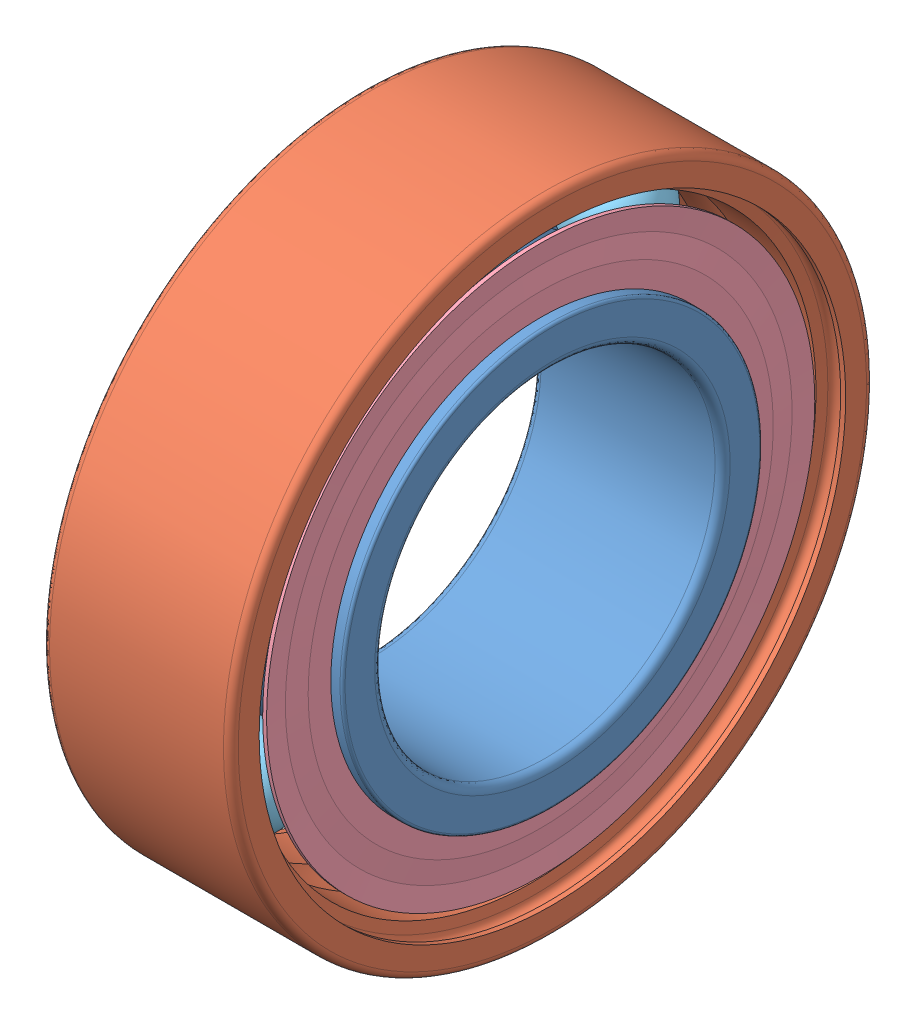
SolidWorks assembly 17mmx9mm.sldasm, configuration Default (file format 16000). Lengths in mm.
Overall size (5 17 17).
13 component instances, 5 part files, 0 mates.
Components (placement in the parent):
- 628_9_2Z_PART1-1: 628_9_2Z_PART1.sldprt [Default] at origin size (5 11.1 11.1)
- 628_9_2Z_PART2-1: 628_9_2Z_PART2.sldprt [Default] at origin size (5 17 17)
- 628_9_2Z_PART3-1: 628_9_2Z_PART3.sldprt [Default] at origin size (0.21 14.5 14.5)
- 628_9_2Z_PART4-1: 628_9_2Z_PART4.sldprt [Default] at origin size (0.21 14.5 14.5)
- 628_9_2Z_PART5-1: 628_9_2Z_PART5.sldprt [Default] at origin size (2.38 2.38 2.38)
- 628_9_2Z_PART5-2: 628_9_2Z_PART5.sldprt [Default] x (1 0 0) z (0 0.642788 0.766044) size (2.38 2.38 2.38)
- 628_9_2Z_PART5-3: 628_9_2Z_PART5.sldprt [Default] x (1 0 0) z (0 0.984808 0.173648) size (2.38 2.38 2.38)
- 628_9_2Z_PART5-4: 628_9_2Z_PART5.sldprt [Default] x (1 0 0) z (0 0.866025 -0.5) size (2.38 2.38 2.38)
- 628_9_2Z_PART5-5: 628_9_2Z_PART5.sldprt [Default] x (1 0 0) z (0 0.34202 -0.939693) size (2.38 2.38 2.38)
- 628_9_2Z_PART5-6: 628_9_2Z_PART5.sldprt [Default] x (1 0 0) z (0 -0.34202 -0.939693) size (2.38 2.38 2.38)
- 628_9_2Z_PART5-7: 628_9_2Z_PART5.sldprt [Default] x (1 0 0) z (0 -0.866025 -0.5) size (2.38 2.38 2.38)
- 628_9_2Z_PART5-8: 628_9_2Z_PART5.sldprt [Default] x (1 0 0) z (0 -0.984808 0.173648) size (2.38 2.38 2.38)
- 628_9_2Z_PART5-9: 628_9_2Z_PART5.sldprt [Default] x (1 0 0) z (0 -0.642788 0.766044) size (2.38 2.38 2.38)
